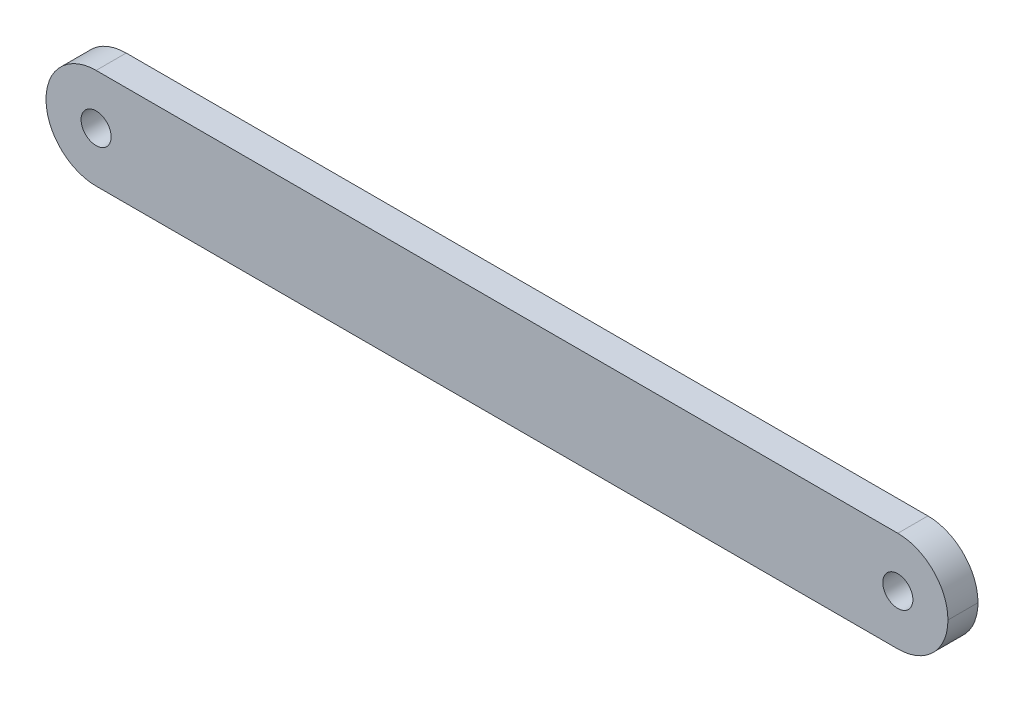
ISO-10303-21;
HEADER;
FILE_DESCRIPTION(('STEP AP214'),'2;1');
FILE_NAME('part.step','',(''),(''),'','','');
FILE_SCHEMA(('AUTOMOTIVE_DESIGN { 1 0 10303 214 1 1 1 1 }'));
ENDSEC;
DATA;
#1=APPLICATION_CONTEXT('core data for automotive mechanical design processes');
#2=APPLICATION_PROTOCOL_DEFINITION('international standard','automotive_design',2000,#1);
#3=PRODUCT_CONTEXT('',#1,'mechanical');
#4=PRODUCT('Part','Part','',(#3));
#5=PRODUCT_RELATED_PRODUCT_CATEGORY('part','',(#4));
#6=PRODUCT_DEFINITION_FORMATION('','',#4);
#7=PRODUCT_DEFINITION_CONTEXT('part definition',#1,'design');
#8=PRODUCT_DEFINITION('design','',#6,#7);
#9=PRODUCT_DEFINITION_SHAPE('','',#8);
#10=(LENGTH_UNIT() NAMED_UNIT(*) SI_UNIT(.MILLI.,.METRE.));
#11=(NAMED_UNIT(*) PLANE_ANGLE_UNIT() SI_UNIT($,.RADIAN.));
#12=(NAMED_UNIT(*) SI_UNIT($,.STERADIAN.) SOLID_ANGLE_UNIT());
#13=UNCERTAINTY_MEASURE_WITH_UNIT(LENGTH_MEASURE(1.E-05),#10,'distance_accuracy_value','');
#14=(GEOMETRIC_REPRESENTATION_CONTEXT(3) GLOBAL_UNCERTAINTY_ASSIGNED_CONTEXT((#13)) GLOBAL_UNIT_ASSIGNED_CONTEXT((#10,
#11,#12)) REPRESENTATION_CONTEXT('',''));
#15=CARTESIAN_POINT('',(0.,0.,0.));
#16=DIRECTION('',(0.,0.,1.));
#17=DIRECTION('',(1.,0.,0.));
#18=AXIS2_PLACEMENT_3D('',#15,#16,#17);
#19=CARTESIAN_POINT('',(0.,0.,3.));
#20=DIRECTION('',(0.,1.,0.));
#21=DIRECTION('',(0.,0.,1.));
#22=AXIS2_PLACEMENT_3D('',#19,#20,#21);
#23=PLANE('',#22);
#24=DIRECTION('',(1.,0.,0.));
#25=VECTOR('',#24,1.);
#26=CARTESIAN_POINT('',(0.,0.,3.));
#27=LINE('',#26,#25);
#28=CARTESIAN_POINT('',(5.,0.,3.));
#29=VERTEX_POINT('',#28);
#30=CARTESIAN_POINT('',(85.,0.,3.));
#31=VERTEX_POINT('',#30);
#32=EDGE_CURVE('E104',#29,#31,#27,.T.);
#33=ORIENTED_EDGE('',*,*,#32,.F.);
#34=DIRECTION('',(0.,0.,-1.));
#35=VECTOR('',#34,1.);
#36=CARTESIAN_POINT('',(5.,0.,3.));
#37=LINE('',#36,#35);
#38=CARTESIAN_POINT('',(5.,0.,0.));
#39=VERTEX_POINT('',#38);
#40=EDGE_CURVE('E93',#29,#39,#37,.T.);
#41=ORIENTED_EDGE('',*,*,#40,.T.);
#42=DIRECTION('',(1.,0.,0.));
#43=VECTOR('',#42,1.);
#44=CARTESIAN_POINT('',(0.,0.,0.));
#45=LINE('',#44,#43);
#46=CARTESIAN_POINT('',(85.,0.,0.));
#47=VERTEX_POINT('',#46);
#48=EDGE_CURVE('E105',#39,#47,#45,.T.);
#49=ORIENTED_EDGE('',*,*,#48,.T.);
#50=DIRECTION('',(0.,0.,-1.));
#51=VECTOR('',#50,1.);
#52=CARTESIAN_POINT('',(85.,0.,3.));
#53=LINE('',#52,#51);
#54=EDGE_CURVE('E113',#47,#31,#53,.F.);
#55=ORIENTED_EDGE('',*,*,#54,.T.);
#56=EDGE_LOOP('',(#33,#41,#49,#55));
#57=FACE_BOUND('',#56,.T.);
#58=ADVANCED_FACE('F33',(#57),#23,.F.);
#59=CARTESIAN_POINT('',(0.,10.,3.));
#60=DIRECTION('',(0.,-1.,0.));
#61=DIRECTION('',(0.,0.,-1.));
#62=AXIS2_PLACEMENT_3D('',#59,#60,#61);
#63=PLANE('',#62);
#64=DIRECTION('',(-1.,0.,0.));
#65=VECTOR('',#64,1.);
#66=CARTESIAN_POINT('',(0.,10.,0.));
#67=LINE('',#66,#65);
#68=CARTESIAN_POINT('',(85.,10.,0.));
#69=VERTEX_POINT('',#68);
#70=CARTESIAN_POINT('',(5.,10.,0.));
#71=VERTEX_POINT('',#70);
#72=EDGE_CURVE('E88',#69,#71,#67,.T.);
#73=ORIENTED_EDGE('',*,*,#72,.T.);
#74=DIRECTION('',(0.,0.,-1.));
#75=VECTOR('',#74,1.);
#76=CARTESIAN_POINT('',(5.,10.,3.));
#77=LINE('',#76,#75);
#78=CARTESIAN_POINT('',(5.,10.,3.));
#79=VERTEX_POINT('',#78);
#80=EDGE_CURVE('E11',#71,#79,#77,.F.);
#81=ORIENTED_EDGE('',*,*,#80,.T.);
#82=DIRECTION('',(-1.,0.,0.));
#83=VECTOR('',#82,1.);
#84=CARTESIAN_POINT('',(0.,10.,3.));
#85=LINE('',#84,#83);
#86=CARTESIAN_POINT('',(85.,10.,3.));
#87=VERTEX_POINT('',#86);
#88=EDGE_CURVE('E89',#87,#79,#85,.T.);
#89=ORIENTED_EDGE('',*,*,#88,.F.);
#90=DIRECTION('',(0.,0.,-1.));
#91=VECTOR('',#90,1.);
#92=CARTESIAN_POINT('',(85.,10.,3.));
#93=LINE('',#92,#91);
#94=EDGE_CURVE('E85',#87,#69,#93,.T.);
#95=ORIENTED_EDGE('',*,*,#94,.T.);
#96=EDGE_LOOP('',(#73,#81,#89,#95));
#97=FACE_BOUND('',#96,.T.);
#98=ADVANCED_FACE('F87',(#97),#63,.F.);
#99=CARTESIAN_POINT('',(0.,10.,3.));
#100=DIRECTION('',(0.,0.,-1.));
#101=DIRECTION('',(-1.,0.,0.));
#102=AXIS2_PLACEMENT_3D('',#99,#100,#101);
#103=PLANE('',#102);
#104=CARTESIAN_POINT('',(85.,5.,3.));
#105=DIRECTION('',(0.,0.,1.));
#106=DIRECTION('',(1.,0.,0.));
#107=AXIS2_PLACEMENT_3D('',#104,#105,#106);
#108=CIRCLE('',#107,1.5);
#109=CARTESIAN_POINT('',(86.5,5.,3.));
#110=VERTEX_POINT('',#109);
#111=EDGE_CURVE('E152',#110,#110,#108,.T.);
#112=ORIENTED_EDGE('',*,*,#111,.F.);
#113=EDGE_LOOP('',(#112));
#114=FACE_BOUND('',#113,.T.);
#115=CARTESIAN_POINT('',(5.,5.,3.));
#116=DIRECTION('',(0.,0.,1.));
#117=DIRECTION('',(1.,0.,0.));
#118=AXIS2_PLACEMENT_3D('',#115,#116,#117);
#119=CIRCLE('',#118,1.5);
#120=CARTESIAN_POINT('',(6.5,5.,3.));
#121=VERTEX_POINT('',#120);
#122=EDGE_CURVE('E144',#121,#121,#119,.T.);
#123=ORIENTED_EDGE('',*,*,#122,.F.);
#124=EDGE_LOOP('',(#123));
#125=FACE_BOUND('',#124,.T.);
#126=CARTESIAN_POINT('',(5.,5.,3.));
#127=DIRECTION('',(0.,0.,-1.));
#128=DIRECTION('',(-1.,0.,0.));
#129=AXIS2_PLACEMENT_3D('',#126,#127,#128);
#130=CIRCLE('',#129,5.);
#131=CARTESIAN_POINT('',(0.,5.,3.));
#132=VERTEX_POINT('',#131);
#133=EDGE_CURVE('E49',#79,#132,#130,.F.);
#134=ORIENTED_EDGE('',*,*,#133,.T.);
#135=CARTESIAN_POINT('',(5.,5.,3.));
#136=DIRECTION('',(0.,0.,-1.));
#137=DIRECTION('',(-1.,0.,0.));
#138=AXIS2_PLACEMENT_3D('',#135,#136,#137);
#139=CIRCLE('',#138,5.);
#140=EDGE_CURVE('E42',#132,#29,#139,.F.);
#141=ORIENTED_EDGE('',*,*,#140,.T.);
#142=ORIENTED_EDGE('',*,*,#32,.T.);
#143=CARTESIAN_POINT('',(85.,5.,3.));
#144=DIRECTION('',(0.,0.,-1.));
#145=DIRECTION('',(-1.,0.,0.));
#146=AXIS2_PLACEMENT_3D('',#143,#144,#145);
#147=CIRCLE('',#146,5.);
#148=CARTESIAN_POINT('',(90.,5.,3.));
#149=VERTEX_POINT('',#148);
#150=EDGE_CURVE('E94',#31,#149,#147,.F.);
#151=ORIENTED_EDGE('',*,*,#150,.T.);
#152=CARTESIAN_POINT('',(85.,5.,3.));
#153=DIRECTION('',(0.,0.,-1.));
#154=DIRECTION('',(-1.,0.,0.));
#155=AXIS2_PLACEMENT_3D('',#152,#153,#154);
#156=CIRCLE('',#155,5.);
#157=EDGE_CURVE('E120',#149,#87,#156,.F.);
#158=ORIENTED_EDGE('',*,*,#157,.T.);
#159=ORIENTED_EDGE('',*,*,#88,.T.);
#160=EDGE_LOOP('',(#134,#141,#142,#151,#158,#159));
#161=FACE_BOUND('',#160,.T.);
#162=ADVANCED_FACE('F132',(#114,#125,#161),#103,.F.);
#163=CARTESIAN_POINT('',(0.,10.,0.));
#164=DIRECTION('',(0.,0.,-1.));
#165=DIRECTION('',(-1.,0.,0.));
#166=AXIS2_PLACEMENT_3D('',#163,#164,#165);
#167=PLANE('',#166);
#168=CARTESIAN_POINT('',(85.,5.,0.));
#169=DIRECTION('',(0.,0.,1.));
#170=DIRECTION('',(1.,0.,0.));
#171=AXIS2_PLACEMENT_3D('',#168,#169,#170);
#172=CIRCLE('',#171,1.5);
#173=CARTESIAN_POINT('',(86.5,5.,0.));
#174=VERTEX_POINT('',#173);
#175=EDGE_CURVE('E149',#174,#174,#172,.T.);
#176=ORIENTED_EDGE('',*,*,#175,.T.);
#177=EDGE_LOOP('',(#176));
#178=FACE_BOUND('',#177,.T.);
#179=CARTESIAN_POINT('',(5.,5.,0.));
#180=DIRECTION('',(0.,0.,1.));
#181=DIRECTION('',(1.,0.,0.));
#182=AXIS2_PLACEMENT_3D('',#179,#180,#181);
#183=CIRCLE('',#182,1.5);
#184=CARTESIAN_POINT('',(6.5,5.,0.));
#185=VERTEX_POINT('',#184);
#186=EDGE_CURVE('E142',#185,#185,#183,.T.);
#187=ORIENTED_EDGE('',*,*,#186,.T.);
#188=EDGE_LOOP('',(#187));
#189=FACE_BOUND('',#188,.T.);
#190=ORIENTED_EDGE('',*,*,#48,.F.);
#191=CARTESIAN_POINT('',(5.,5.,0.));
#192=DIRECTION('',(0.,0.,-1.));
#193=DIRECTION('',(-1.,0.,0.));
#194=AXIS2_PLACEMENT_3D('',#191,#192,#193);
#195=CIRCLE('',#194,5.);
#196=CARTESIAN_POINT('',(0.,5.,0.));
#197=VERTEX_POINT('',#196);
#198=EDGE_CURVE('E127',#39,#197,#195,.T.);
#199=ORIENTED_EDGE('',*,*,#198,.T.);
#200=CARTESIAN_POINT('',(5.,5.,0.));
#201=DIRECTION('',(0.,0.,-1.));
#202=DIRECTION('',(-1.,0.,0.));
#203=AXIS2_PLACEMENT_3D('',#200,#201,#202);
#204=CIRCLE('',#203,5.);
#205=EDGE_CURVE('E103',#197,#71,#204,.T.);
#206=ORIENTED_EDGE('',*,*,#205,.T.);
#207=ORIENTED_EDGE('',*,*,#72,.F.);
#208=CARTESIAN_POINT('',(85.,5.,0.));
#209=DIRECTION('',(0.,0.,-1.));
#210=DIRECTION('',(-1.,0.,0.));
#211=AXIS2_PLACEMENT_3D('',#208,#209,#210);
#212=CIRCLE('',#211,5.);
#213=CARTESIAN_POINT('',(90.,5.,0.));
#214=VERTEX_POINT('',#213);
#215=EDGE_CURVE('E100',#69,#214,#212,.T.);
#216=ORIENTED_EDGE('',*,*,#215,.T.);
#217=CARTESIAN_POINT('',(85.,5.,0.));
#218=DIRECTION('',(0.,0.,-1.));
#219=DIRECTION('',(-1.,0.,0.));
#220=AXIS2_PLACEMENT_3D('',#217,#218,#219);
#221=CIRCLE('',#220,5.);
#222=EDGE_CURVE('E111',#214,#47,#221,.T.);
#223=ORIENTED_EDGE('',*,*,#222,.T.);
#224=EDGE_LOOP('',(#190,#199,#206,#207,#216,#223));
#225=FACE_BOUND('',#224,.T.);
#226=ADVANCED_FACE('F98',(#178,#189,#225),#167,.T.);
#227=CARTESIAN_POINT('',(85.,5.,3.));
#228=DIRECTION('',(0.,0.,-1.));
#229=DIRECTION('',(-1.,0.,0.));
#230=AXIS2_PLACEMENT_3D('',#227,#228,#229);
#231=CYLINDRICAL_SURFACE('',#230,5.);
#232=ORIENTED_EDGE('',*,*,#94,.F.);
#233=ORIENTED_EDGE('',*,*,#157,.F.);
#234=DIRECTION('',(0.,0.,-1.));
#235=VECTOR('',#234,1.);
#236=CARTESIAN_POINT('',(90.,5.,3.));
#237=LINE('',#236,#235);
#238=EDGE_CURVE('E109',#214,#149,#237,.F.);
#239=ORIENTED_EDGE('',*,*,#238,.F.);
#240=ORIENTED_EDGE('',*,*,#215,.F.);
#241=EDGE_LOOP('',(#232,#233,#239,#240));
#242=FACE_BOUND('',#241,.T.);
#243=ADVANCED_FACE('F107',(#242),#231,.T.);
#244=CARTESIAN_POINT('',(85.,5.,3.));
#245=DIRECTION('',(0.,0.,-1.));
#246=DIRECTION('',(-1.,0.,0.));
#247=AXIS2_PLACEMENT_3D('',#244,#245,#246);
#248=CYLINDRICAL_SURFACE('',#247,5.);
#249=ORIENTED_EDGE('',*,*,#150,.F.);
#250=ORIENTED_EDGE('',*,*,#54,.F.);
#251=ORIENTED_EDGE('',*,*,#222,.F.);
#252=ORIENTED_EDGE('',*,*,#238,.T.);
#253=EDGE_LOOP('',(#249,#250,#251,#252));
#254=FACE_BOUND('',#253,.T.);
#255=ADVANCED_FACE('F155',(#254),#248,.T.);
#256=CARTESIAN_POINT('',(5.,5.,3.));
#257=DIRECTION('',(0.,0.,-1.));
#258=DIRECTION('',(-1.,0.,0.));
#259=AXIS2_PLACEMENT_3D('',#256,#257,#258);
#260=CYLINDRICAL_SURFACE('',#259,5.);
#261=DIRECTION('',(0.,0.,-1.));
#262=VECTOR('',#261,1.);
#263=CARTESIAN_POINT('',(0.,5.,3.));
#264=LINE('',#263,#262);
#265=EDGE_CURVE('E37',#132,#197,#264,.T.);
#266=ORIENTED_EDGE('',*,*,#265,.F.);
#267=ORIENTED_EDGE('',*,*,#133,.F.);
#268=ORIENTED_EDGE('',*,*,#80,.F.);
#269=ORIENTED_EDGE('',*,*,#205,.F.);
#270=EDGE_LOOP('',(#266,#267,#268,#269));
#271=FACE_BOUND('',#270,.T.);
#272=ADVANCED_FACE('F35',(#271),#260,.T.);
#273=CARTESIAN_POINT('',(5.,5.,3.));
#274=DIRECTION('',(0.,0.,-1.));
#275=DIRECTION('',(-1.,0.,0.));
#276=AXIS2_PLACEMENT_3D('',#273,#274,#275);
#277=CYLINDRICAL_SURFACE('',#276,5.);
#278=ORIENTED_EDGE('',*,*,#140,.F.);
#279=ORIENTED_EDGE('',*,*,#265,.T.);
#280=ORIENTED_EDGE('',*,*,#198,.F.);
#281=ORIENTED_EDGE('',*,*,#40,.F.);
#282=EDGE_LOOP('',(#278,#279,#280,#281));
#283=FACE_BOUND('',#282,.T.);
#284=ADVANCED_FACE('F140',(#283),#277,.T.);
#285=CARTESIAN_POINT('',(5.,5.,0.));
#286=DIRECTION('',(0.,0.,1.));
#287=DIRECTION('',(1.,0.,0.));
#288=AXIS2_PLACEMENT_3D('',#285,#286,#287);
#289=CYLINDRICAL_SURFACE('',#288,1.5);
#290=ORIENTED_EDGE('',*,*,#186,.F.);
#291=EDGE_LOOP('',(#290));
#292=FACE_BOUND('',#291,.T.);
#293=ORIENTED_EDGE('',*,*,#122,.T.);
#294=EDGE_LOOP('',(#293));
#295=FACE_BOUND('',#294,.T.);
#296=ADVANCED_FACE('F176',(#292,#295),#289,.F.);
#297=CARTESIAN_POINT('',(85.,5.,0.));
#298=DIRECTION('',(0.,0.,1.));
#299=DIRECTION('',(1.,0.,0.));
#300=AXIS2_PLACEMENT_3D('',#297,#298,#299);
#301=CYLINDRICAL_SURFACE('',#300,1.5);
#302=ORIENTED_EDGE('',*,*,#175,.F.);
#303=EDGE_LOOP('',(#302));
#304=FACE_BOUND('',#303,.T.);
#305=ORIENTED_EDGE('',*,*,#111,.T.);
#306=EDGE_LOOP('',(#305));
#307=FACE_BOUND('',#306,.T.);
#308=ADVANCED_FACE('F179',(#304,#307),#301,.F.);
#309=CLOSED_SHELL('',(#58,#98,#162,#226,#243,#255,#272,#284,#296,#308));
#310=MANIFOLD_SOLID_BREP('B2',#309);
#311=ADVANCED_BREP_SHAPE_REPRESENTATION('',(#18,#310),#14);
#312=SHAPE_DEFINITION_REPRESENTATION(#9,#311);
ENDSEC;
END-ISO-10303-21;
